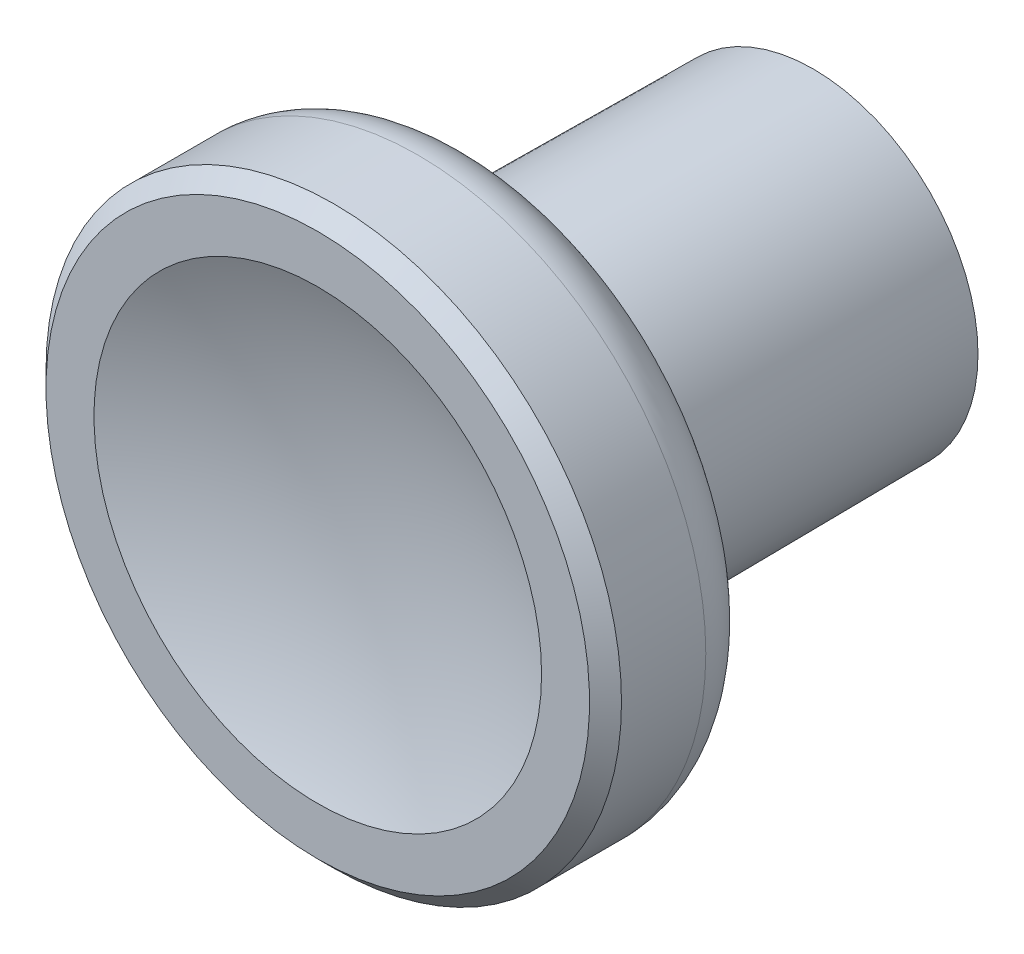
ISO-10303-21;
HEADER;
FILE_DESCRIPTION(('STEP AP214'),'2;1');
FILE_NAME('part.step','',(''),(''),'','','');
FILE_SCHEMA(('AUTOMOTIVE_DESIGN { 1 0 10303 214 1 1 1 1 }'));
ENDSEC;
DATA;
#1=APPLICATION_CONTEXT('core data for automotive mechanical design processes');
#2=APPLICATION_PROTOCOL_DEFINITION('international standard','automotive_design',2000,#1);
#3=PRODUCT_CONTEXT('',#1,'mechanical');
#4=PRODUCT('Part','Part','',(#3));
#5=PRODUCT_RELATED_PRODUCT_CATEGORY('part','',(#4));
#6=PRODUCT_DEFINITION_FORMATION('','',#4);
#7=PRODUCT_DEFINITION_CONTEXT('part definition',#1,'design');
#8=PRODUCT_DEFINITION('design','',#6,#7);
#9=PRODUCT_DEFINITION_SHAPE('','',#8);
#10=(LENGTH_UNIT() NAMED_UNIT(*) SI_UNIT(.MILLI.,.METRE.));
#11=(NAMED_UNIT(*) PLANE_ANGLE_UNIT() SI_UNIT($,.RADIAN.));
#12=(NAMED_UNIT(*) SI_UNIT($,.STERADIAN.) SOLID_ANGLE_UNIT());
#13=UNCERTAINTY_MEASURE_WITH_UNIT(LENGTH_MEASURE(1.E-05),#10,'distance_accuracy_value','');
#14=(GEOMETRIC_REPRESENTATION_CONTEXT(3) GLOBAL_UNCERTAINTY_ASSIGNED_CONTEXT((#13)) GLOBAL_UNIT_ASSIGNED_CONTEXT((#10,
#11,#12)) REPRESENTATION_CONTEXT('',''));
#15=CARTESIAN_POINT('',(0.,0.,0.));
#16=DIRECTION('',(0.,0.,1.));
#17=DIRECTION('',(1.,0.,0.));
#18=AXIS2_PLACEMENT_3D('',#15,#16,#17);
#19=CARTESIAN_POINT('',(5.15,0.,0.));
#20=DIRECTION('',(0.,0.,-1.));
#21=DIRECTION('',(0.,1.,0.));
#22=AXIS2_PLACEMENT_3D('',#19,#20,#21);
#23=PLANE('',#22);
#24=CARTESIAN_POINT('',(0.,0.,0.));
#25=DIRECTION('',(0.,0.,-1.));
#26=DIRECTION('',(0.,1.,0.));
#27=AXIS2_PLACEMENT_3D('',#24,#25,#26);
#28=CIRCLE('',#27,2.);
#29=CARTESIAN_POINT('',(0.,2.,0.));
#30=VERTEX_POINT('',#29);
#31=EDGE_CURVE('E43',#30,#30,#28,.T.);
#32=ORIENTED_EDGE('',*,*,#31,.F.);
#33=EDGE_LOOP('',(#32));
#34=FACE_BOUND('',#33,.T.);
#35=CARTESIAN_POINT('',(0.,0.,0.));
#36=DIRECTION('',(0.,0.,-1.));
#37=DIRECTION('',(0.,1.,0.));
#38=AXIS2_PLACEMENT_3D('',#35,#36,#37);
#39=CIRCLE('',#38,5.15);
#40=CARTESIAN_POINT('',(0.,5.15,0.));
#41=VERTEX_POINT('',#40);
#42=EDGE_CURVE('E8',#41,#41,#39,.T.);
#43=ORIENTED_EDGE('',*,*,#42,.T.);
#44=EDGE_LOOP('',(#43));
#45=FACE_BOUND('',#44,.T.);
#46=ADVANCED_FACE('F12',(#34,#45),#23,.T.);
#47=CARTESIAN_POINT('',(0.,0.,0.));
#48=DIRECTION('',(0.,0.,1.));
#49=DIRECTION('',(0.,-1.,0.));
#50=AXIS2_PLACEMENT_3D('',#47,#48,#49);
#51=CONICAL_SURFACE('',#50,5.15,0.00872664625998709);
#52=CARTESIAN_POINT('',(0.,0.,9.365716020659));
#53=DIRECTION('',(0.,0.,-1.));
#54=DIRECTION('',(0.,1.,0.));
#55=AXIS2_PLACEMENT_3D('',#52,#53,#54);
#56=CIRCLE('',#55,5.23173336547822);
#57=CARTESIAN_POINT('',(0.,5.23173336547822,9.365716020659));
#58=VERTEX_POINT('',#57);
#59=EDGE_CURVE('E18',#58,#58,#56,.T.);
#60=ORIENTED_EDGE('',*,*,#59,.T.);
#61=EDGE_LOOP('',(#60));
#62=FACE_BOUND('',#61,.T.);
#63=ORIENTED_EDGE('',*,*,#42,.F.);
#64=EDGE_LOOP('',(#63));
#65=FACE_BOUND('',#64,.T.);
#66=ADVANCED_FACE('F68',(#62,#65),#51,.T.);
#67=CARTESIAN_POINT('',(0.,0.,9.35873479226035));
#68=DIRECTION('',(0.,0.,-1.));
#69=DIRECTION('',(0.,1.,0.));
#70=AXIS2_PLACEMENT_3D('',#67,#68,#69);
#71=TOROIDAL_SURFACE('',#70,6.03170290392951,0.799999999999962);
#72=CARTESIAN_POINT('',(0.,0.,10.1314754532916));
#73=DIRECTION('',(0.,0.,-1.));
#74=DIRECTION('',(0.,1.,0.));
#75=AXIS2_PLACEMENT_3D('',#72,#73,#74);
#76=CIRCLE('',#75,5.82464766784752);
#77=CARTESIAN_POINT('',(0.,5.82464766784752,10.1314754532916));
#78=VERTEX_POINT('',#77);
#79=EDGE_CURVE('E22',#78,#78,#76,.T.);
#80=ORIENTED_EDGE('',*,*,#79,.T.);
#81=EDGE_LOOP('',(#80));
#82=FACE_BOUND('',#81,.T.);
#83=ORIENTED_EDGE('',*,*,#59,.F.);
#84=EDGE_LOOP('',(#83));
#85=FACE_BOUND('',#84,.T.);
#86=ADVANCED_FACE('F74',(#82,#85),#71,.F.);
#87=CARTESIAN_POINT('',(0.,0.,10.1314754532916));
#88=DIRECTION('',(0.,0.,1.));
#89=DIRECTION('',(0.,-1.,0.));
#90=AXIS2_PLACEMENT_3D('',#87,#88,#89);
#91=CONICAL_SURFACE('',#90,5.82464766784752,1.3089969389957);
#92=CARTESIAN_POINT('',(0.,0.,10.624830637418));
#93=DIRECTION('',(0.,0.,-1.));
#94=DIRECTION('',(0.,1.,0.));
#95=AXIS2_PLACEMENT_3D('',#92,#93,#94);
#96=CIRCLE('',#95,7.6658742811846);
#97=CARTESIAN_POINT('',(0.,7.6658742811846,10.624830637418));
#98=VERTEX_POINT('',#97);
#99=EDGE_CURVE('E26',#98,#98,#96,.T.);
#100=ORIENTED_EDGE('',*,*,#99,.T.);
#101=EDGE_LOOP('',(#100));
#102=FACE_BOUND('',#101,.T.);
#103=ORIENTED_EDGE('',*,*,#79,.F.);
#104=EDGE_LOOP('',(#103));
#105=FACE_BOUND('',#104,.T.);
#106=ADVANCED_FACE('F80',(#102,#105),#91,.T.);
#107=CARTESIAN_POINT('',(0.,0.,12.3634971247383));
#108=DIRECTION('',(0.,0.,-1.));
#109=DIRECTION('',(0.,1.,0.));
#110=AXIS2_PLACEMENT_3D('',#107,#108,#109);
#111=TOROIDAL_SURFACE('',#110,7.2,1.8);
#112=CARTESIAN_POINT('',(0.,0.,12.3634971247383));
#113=DIRECTION('',(0.,0.,-1.));
#114=DIRECTION('',(0.,1.,0.));
#115=AXIS2_PLACEMENT_3D('',#112,#113,#114);
#116=CIRCLE('',#115,9.);
#117=CARTESIAN_POINT('',(0.,9.,12.3634971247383));
#118=VERTEX_POINT('',#117);
#119=EDGE_CURVE('E31',#118,#118,#116,.T.);
#120=ORIENTED_EDGE('',*,*,#119,.T.);
#121=EDGE_LOOP('',(#120));
#122=FACE_BOUND('',#121,.T.);
#123=ORIENTED_EDGE('',*,*,#99,.F.);
#124=EDGE_LOOP('',(#123));
#125=FACE_BOUND('',#124,.T.);
#126=ADVANCED_FACE('F87',(#122,#125),#111,.T.);
#127=CARTESIAN_POINT('',(0.,0.,0.));
#128=DIRECTION('',(0.,0.,-1.));
#129=DIRECTION('',(0.,1.,0.));
#130=AXIS2_PLACEMENT_3D('',#127,#128,#129);
#131=CYLINDRICAL_SURFACE('',#130,9.);
#132=CARTESIAN_POINT('',(0.,0.,15.));
#133=DIRECTION('',(0.,0.,-1.));
#134=DIRECTION('',(0.,1.,0.));
#135=AXIS2_PLACEMENT_3D('',#132,#133,#134);
#136=CIRCLE('',#135,9.);
#137=CARTESIAN_POINT('',(0.,9.,15.));
#138=VERTEX_POINT('',#137);
#139=EDGE_CURVE('E34',#138,#138,#136,.T.);
#140=ORIENTED_EDGE('',*,*,#139,.T.);
#141=EDGE_LOOP('',(#140));
#142=FACE_BOUND('',#141,.T.);
#143=ORIENTED_EDGE('',*,*,#119,.F.);
#144=EDGE_LOOP('',(#143));
#145=FACE_BOUND('',#144,.T.);
#146=ADVANCED_FACE('F91',(#142,#145),#131,.T.);
#147=CARTESIAN_POINT('',(0.,0.,15.));
#148=DIRECTION('',(0.,0.,-1.));
#149=DIRECTION('',(0.,1.,0.));
#150=AXIS2_PLACEMENT_3D('',#147,#148,#149);
#151=CONICAL_SURFACE('',#150,9.,0.785398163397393);
#152=CARTESIAN_POINT('',(0.,0.,15.5));
#153=DIRECTION('',(0.,0.,-1.));
#154=DIRECTION('',(0.,1.,0.));
#155=AXIS2_PLACEMENT_3D('',#152,#153,#154);
#156=CIRCLE('',#155,8.5);
#157=CARTESIAN_POINT('',(0.,8.5,15.5));
#158=VERTEX_POINT('',#157);
#159=EDGE_CURVE('E37',#158,#158,#156,.T.);
#160=ORIENTED_EDGE('',*,*,#159,.T.);
#161=EDGE_LOOP('',(#160));
#162=FACE_BOUND('',#161,.T.);
#163=ORIENTED_EDGE('',*,*,#139,.F.);
#164=EDGE_LOOP('',(#163));
#165=FACE_BOUND('',#164,.T.);
#166=ADVANCED_FACE('F95',(#162,#165),#151,.T.);
#167=CARTESIAN_POINT('',(7.,0.,15.5));
#168=DIRECTION('',(0.,0.,1.));
#169=DIRECTION('',(0.,-1.,0.));
#170=AXIS2_PLACEMENT_3D('',#167,#168,#169);
#171=PLANE('',#170);
#172=CARTESIAN_POINT('',(0.,0.,15.5));
#173=DIRECTION('',(0.,0.,-1.));
#174=DIRECTION('',(0.,1.,0.));
#175=AXIS2_PLACEMENT_3D('',#172,#173,#174);
#176=CIRCLE('',#175,7.);
#177=CARTESIAN_POINT('',(0.,7.,15.5));
#178=VERTEX_POINT('',#177);
#179=EDGE_CURVE('E40',#178,#178,#176,.T.);
#180=ORIENTED_EDGE('',*,*,#179,.T.);
#181=EDGE_LOOP('',(#180));
#182=FACE_BOUND('',#181,.T.);
#183=ORIENTED_EDGE('',*,*,#159,.F.);
#184=EDGE_LOOP('',(#183));
#185=FACE_BOUND('',#184,.T.);
#186=ADVANCED_FACE('F64',(#182,#185),#171,.T.);
#187=CARTESIAN_POINT('',(0.,0.,32.0435211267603));
#188=DIRECTION('',(0.,0.,-1.));
#189=DIRECTION('',(1.,0.,0.));
#190=AXIS2_PLACEMENT_3D('',#187,#188,#189);
#191=SPHERICAL_SURFACE('',#190,17.9635211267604);
#192=ORIENTED_EDGE('',*,*,#179,.F.);
#193=EDGE_LOOP('',(#192));
#194=FACE_BOUND('',#193,.T.);
#195=ADVANCED_FACE('F54',(#194),#191,.F.);
#196=CARTESIAN_POINT('',(0.,0.,5.96));
#197=DIRECTION('',(0.,0.,-1.));
#198=DIRECTION('',(0.,1.,0.));
#199=AXIS2_PLACEMENT_3D('',#196,#197,#198);
#200=CYLINDRICAL_SURFACE('',#199,2.);
#201=ORIENTED_EDGE('',*,*,#31,.T.);
#202=EDGE_LOOP('',(#201));
#203=FACE_BOUND('',#202,.T.);
#204=CARTESIAN_POINT('',(0.,0.,6.));
#205=DIRECTION('',(0.,0.,-1.));
#206=DIRECTION('',(-1.,0.,0.));
#207=AXIS2_PLACEMENT_3D('',#204,#205,#206);
#208=CIRCLE('',#207,2.);
#209=CARTESIAN_POINT('',(-2.,0.,6.));
#210=VERTEX_POINT('',#209);
#211=EDGE_CURVE('E46',#210,#210,#208,.T.);
#212=ORIENTED_EDGE('',*,*,#211,.F.);
#213=EDGE_LOOP('',(#212));
#214=FACE_BOUND('',#213,.T.);
#215=ADVANCED_FACE('F52',(#203,#214),#200,.F.);
#216=CARTESIAN_POINT('',(0.,0.,6.));
#217=DIRECTION('',(0.,0.,-1.));
#218=DIRECTION('',(-1.,0.,0.));
#219=AXIS2_PLACEMENT_3D('',#216,#217,#218);
#220=PLANE('',#219);
#221=ORIENTED_EDGE('',*,*,#211,.T.);
#222=EDGE_LOOP('',(#221));
#223=FACE_BOUND('',#222,.T.);
#224=ADVANCED_FACE('F50',(#223),#220,.T.);
#225=CLOSED_SHELL('',(#46,#66,#86,#106,#126,#146,#166,#186,#195,#215,#224));
#226=MANIFOLD_SOLID_BREP('B1',#225);
#227=ADVANCED_BREP_SHAPE_REPRESENTATION('',(#18,#226),#14);
#228=SHAPE_DEFINITION_REPRESENTATION(#9,#227);
ENDSEC;
END-ISO-10303-21;
